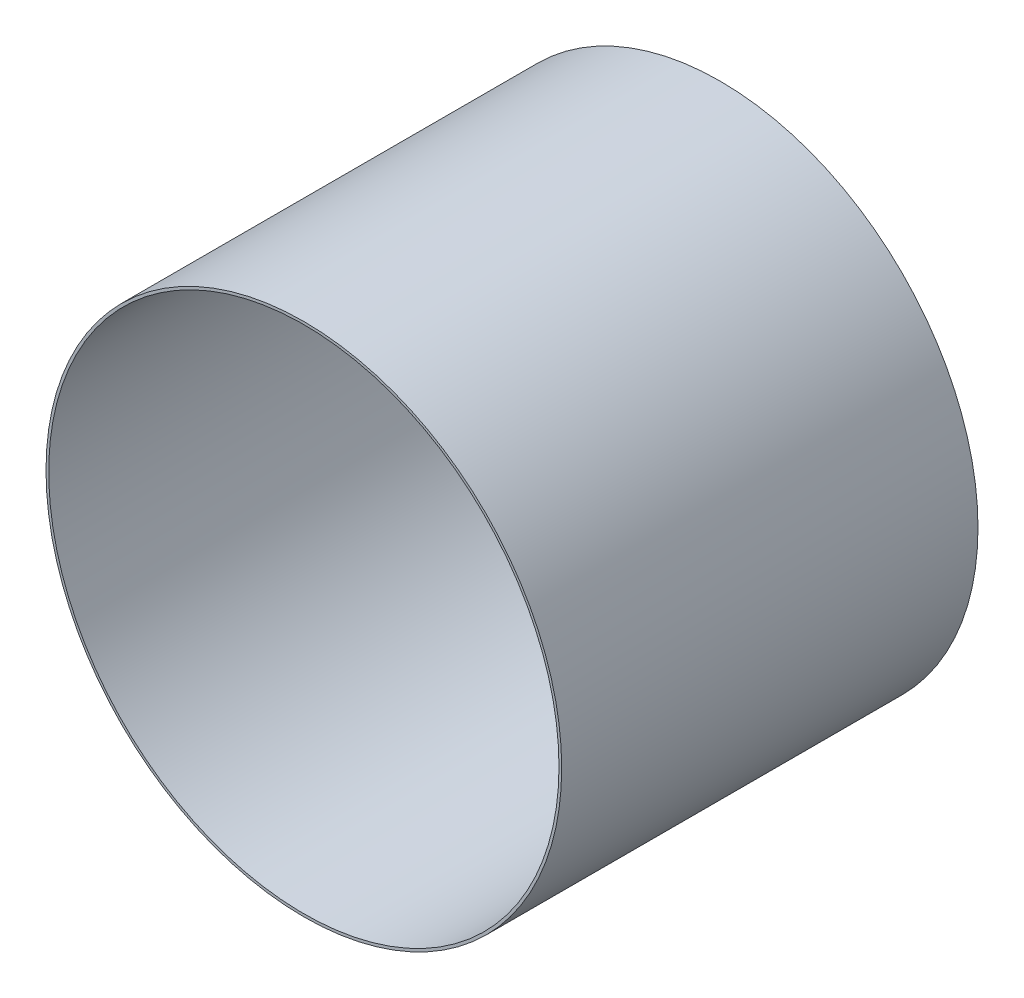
ISO-10303-21;
HEADER;
FILE_DESCRIPTION(('STEP AP214'),'2;1');
FILE_NAME('part.step','',(''),(''),'','','');
FILE_SCHEMA(('AUTOMOTIVE_DESIGN { 1 0 10303 214 1 1 1 1 }'));
ENDSEC;
DATA;
#1=APPLICATION_CONTEXT('core data for automotive mechanical design processes');
#2=APPLICATION_PROTOCOL_DEFINITION('international standard','automotive_design',2000,#1);
#3=PRODUCT_CONTEXT('',#1,'mechanical');
#4=PRODUCT('Part','Part','',(#3));
#5=PRODUCT_RELATED_PRODUCT_CATEGORY('part','',(#4));
#6=PRODUCT_DEFINITION_FORMATION('','',#4);
#7=PRODUCT_DEFINITION_CONTEXT('part definition',#1,'design');
#8=PRODUCT_DEFINITION('design','',#6,#7);
#9=PRODUCT_DEFINITION_SHAPE('','',#8);
#10=(LENGTH_UNIT() NAMED_UNIT(*) SI_UNIT(.MILLI.,.METRE.));
#11=(NAMED_UNIT(*) PLANE_ANGLE_UNIT() SI_UNIT($,.RADIAN.));
#12=(NAMED_UNIT(*) SI_UNIT($,.STERADIAN.) SOLID_ANGLE_UNIT());
#13=UNCERTAINTY_MEASURE_WITH_UNIT(LENGTH_MEASURE(1.E-05),#10,'distance_accuracy_value','');
#14=(GEOMETRIC_REPRESENTATION_CONTEXT(3) GLOBAL_UNCERTAINTY_ASSIGNED_CONTEXT((#13)) GLOBAL_UNIT_ASSIGNED_CONTEXT((#10,
#11,#12)) REPRESENTATION_CONTEXT('',''));
#15=CARTESIAN_POINT('',(0.,0.,0.));
#16=DIRECTION('',(0.,0.,1.));
#17=DIRECTION('',(1.,0.,0.));
#18=AXIS2_PLACEMENT_3D('',#15,#16,#17);
#19=CARTESIAN_POINT('',(0.,0.,-31.));
#20=DIRECTION('',(0.,0.,1.));
#21=DIRECTION('',(1.,0.,0.));
#22=AXIS2_PLACEMENT_3D('',#19,#20,#21);
#23=CYLINDRICAL_SURFACE('',#22,19.2);
#24=CARTESIAN_POINT('',(0.,0.,-31.));
#25=DIRECTION('',(0.,0.,1.));
#26=DIRECTION('',(1.,0.,0.));
#27=AXIS2_PLACEMENT_3D('',#24,#25,#26);
#28=CIRCLE('',#27,19.2);
#29=CARTESIAN_POINT('',(19.2,0.,-31.));
#30=VERTEX_POINT('',#29);
#31=EDGE_CURVE('E10',#30,#30,#28,.T.);
#32=ORIENTED_EDGE('',*,*,#31,.T.);
#33=EDGE_LOOP('',(#32));
#34=FACE_BOUND('',#33,.T.);
#35=CARTESIAN_POINT('',(0.,0.,0.));
#36=DIRECTION('',(0.,0.,1.));
#37=DIRECTION('',(1.,0.,0.));
#38=AXIS2_PLACEMENT_3D('',#35,#36,#37);
#39=CIRCLE('',#38,19.2);
#40=CARTESIAN_POINT('',(19.2,0.,0.));
#41=VERTEX_POINT('',#40);
#42=EDGE_CURVE('E39',#41,#41,#39,.T.);
#43=ORIENTED_EDGE('',*,*,#42,.F.);
#44=EDGE_LOOP('',(#43));
#45=FACE_BOUND('',#44,.T.);
#46=ADVANCED_FACE('F36',(#34,#45),#23,.T.);
#47=CARTESIAN_POINT('',(0.,0.,-31.));
#48=DIRECTION('',(0.,0.,1.));
#49=DIRECTION('',(1.,0.,0.));
#50=AXIS2_PLACEMENT_3D('',#47,#48,#49);
#51=PLANE('',#50);
#52=CARTESIAN_POINT('',(0.,0.,-31.));
#53=DIRECTION('',(0.,0.,1.));
#54=DIRECTION('',(1.,0.,0.));
#55=AXIS2_PLACEMENT_3D('',#52,#53,#54);
#56=CIRCLE('',#55,19.);
#57=CARTESIAN_POINT('',(19.,0.,-31.));
#58=VERTEX_POINT('',#57);
#59=EDGE_CURVE('E46',#58,#58,#56,.T.);
#60=ORIENTED_EDGE('',*,*,#59,.T.);
#61=EDGE_LOOP('',(#60));
#62=FACE_BOUND('',#61,.T.);
#63=ORIENTED_EDGE('',*,*,#31,.F.);
#64=EDGE_LOOP('',(#63));
#65=FACE_BOUND('',#64,.T.);
#66=ADVANCED_FACE('F54',(#62,#65),#51,.F.);
#67=CARTESIAN_POINT('',(0.,0.,0.));
#68=DIRECTION('',(0.,0.,1.));
#69=DIRECTION('',(1.,0.,0.));
#70=AXIS2_PLACEMENT_3D('',#67,#68,#69);
#71=PLANE('',#70);
#72=CARTESIAN_POINT('',(0.,0.,0.));
#73=DIRECTION('',(0.,0.,1.));
#74=DIRECTION('',(1.,0.,0.));
#75=AXIS2_PLACEMENT_3D('',#72,#73,#74);
#76=CIRCLE('',#75,19.);
#77=CARTESIAN_POINT('',(19.,0.,0.));
#78=VERTEX_POINT('',#77);
#79=EDGE_CURVE('E48',#78,#78,#76,.T.);
#80=ORIENTED_EDGE('',*,*,#79,.F.);
#81=EDGE_LOOP('',(#80));
#82=FACE_BOUND('',#81,.T.);
#83=ORIENTED_EDGE('',*,*,#42,.T.);
#84=EDGE_LOOP('',(#83));
#85=FACE_BOUND('',#84,.T.);
#86=ADVANCED_FACE('F60',(#82,#85),#71,.T.);
#87=CARTESIAN_POINT('',(0.,0.,-31.));
#88=DIRECTION('',(0.,0.,1.));
#89=DIRECTION('',(1.,0.,0.));
#90=AXIS2_PLACEMENT_3D('',#87,#88,#89);
#91=CYLINDRICAL_SURFACE('',#90,19.);
#92=ORIENTED_EDGE('',*,*,#59,.F.);
#93=EDGE_LOOP('',(#92));
#94=FACE_BOUND('',#93,.T.);
#95=ORIENTED_EDGE('',*,*,#79,.T.);
#96=EDGE_LOOP('',(#95));
#97=FACE_BOUND('',#96,.T.);
#98=ADVANCED_FACE('F57',(#94,#97),#91,.F.);
#99=CLOSED_SHELL('',(#46,#66,#86,#98));
#100=MANIFOLD_SOLID_BREP('B2',#99);
#101=ADVANCED_BREP_SHAPE_REPRESENTATION('',(#18,#100),#14);
#102=SHAPE_DEFINITION_REPRESENTATION(#9,#101);
ENDSEC;
END-ISO-10303-21;
